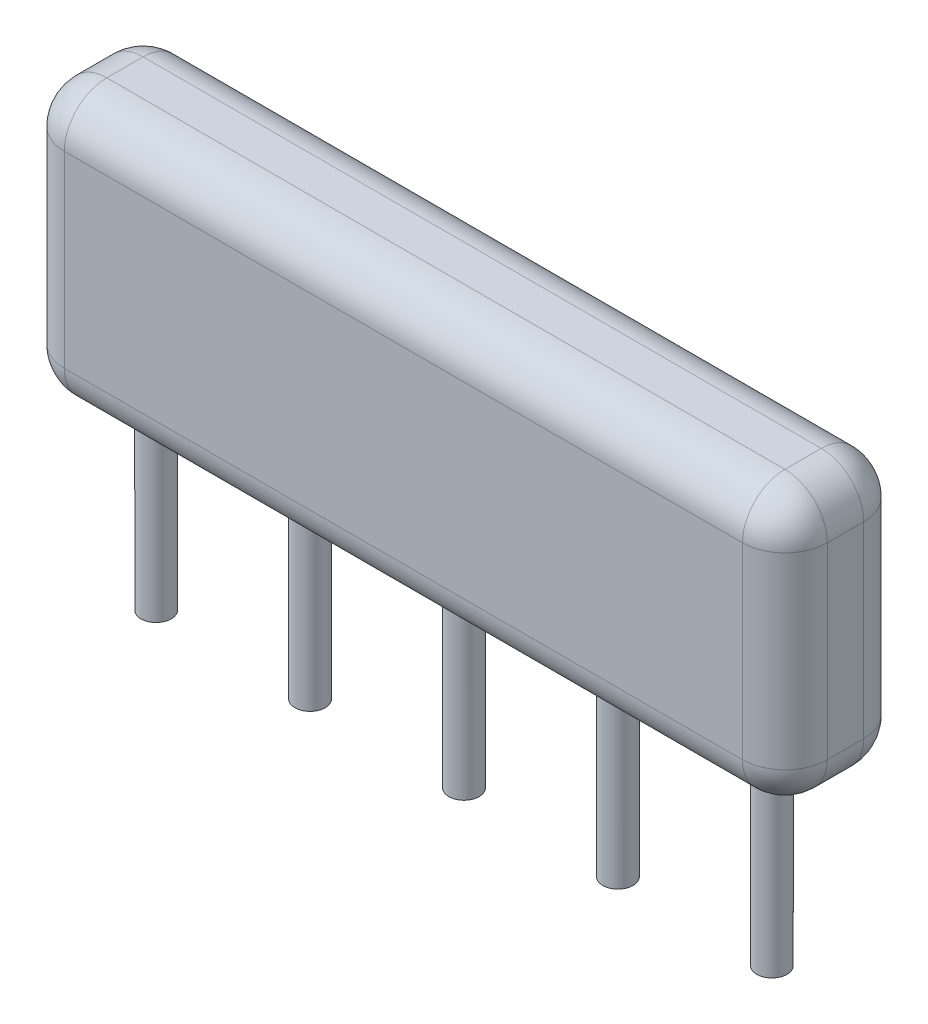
ISO-10303-21;
HEADER;
FILE_DESCRIPTION(('STEP AP214'),'2;1');
FILE_NAME('part.step','',(''),(''),'','','');
FILE_SCHEMA(('AUTOMOTIVE_DESIGN { 1 0 10303 214 1 1 1 1 }'));
ENDSEC;
DATA;
#1=APPLICATION_CONTEXT('core data for automotive mechanical design processes');
#2=APPLICATION_PROTOCOL_DEFINITION('international standard','automotive_design',2000,#1);
#3=PRODUCT_CONTEXT('',#1,'mechanical');
#4=PRODUCT('Part','Part','',(#3));
#5=PRODUCT_RELATED_PRODUCT_CATEGORY('part','',(#4));
#6=PRODUCT_DEFINITION_FORMATION('','',#4);
#7=PRODUCT_DEFINITION_CONTEXT('part definition',#1,'design');
#8=PRODUCT_DEFINITION('design','',#6,#7);
#9=PRODUCT_DEFINITION_SHAPE('','',#8);
#10=(LENGTH_UNIT() NAMED_UNIT(*) SI_UNIT(.MILLI.,.METRE.));
#11=(NAMED_UNIT(*) PLANE_ANGLE_UNIT() SI_UNIT($,.RADIAN.));
#12=(NAMED_UNIT(*) SI_UNIT($,.STERADIAN.) SOLID_ANGLE_UNIT());
#13=UNCERTAINTY_MEASURE_WITH_UNIT(LENGTH_MEASURE(1.E-05),#10,'distance_accuracy_value','');
#14=(GEOMETRIC_REPRESENTATION_CONTEXT(3) GLOBAL_UNCERTAINTY_ASSIGNED_CONTEXT((#13)) GLOBAL_UNIT_ASSIGNED_CONTEXT((#10,
#11,#12)) REPRESENTATION_CONTEXT('',''));
#15=CARTESIAN_POINT('',(0.,0.,0.));
#16=DIRECTION('',(0.,0.,1.));
#17=DIRECTION('',(1.,0.,0.));
#18=AXIS2_PLACEMENT_3D('',#15,#16,#17);
#19=CARTESIAN_POINT('',(0.,0.,2.));
#20=DIRECTION('',(0.,1.,0.));
#21=DIRECTION('',(0.,0.,1.));
#22=AXIS2_PLACEMENT_3D('',#19,#20,#21);
#23=PLANE('',#22);
#24=DIRECTION('',(0.,0.,-1.));
#25=VECTOR('',#24,1.);
#26=CARTESIAN_POINT('',(0.7,0.,2.));
#27=LINE('',#26,#25);
#28=CARTESIAN_POINT('',(0.7,0.,1.3));
#29=VERTEX_POINT('',#28);
#30=CARTESIAN_POINT('',(0.7,0.,0.7));
#31=VERTEX_POINT('',#30);
#32=EDGE_CURVE('E162',#29,#31,#27,.T.);
#33=ORIENTED_EDGE('',*,*,#32,.T.);
#34=DIRECTION('',(1.,0.,0.));
#35=VECTOR('',#34,1.);
#36=CARTESIAN_POINT('',(0.,0.,0.7));
#37=LINE('',#36,#35);
#38=CARTESIAN_POINT('',(11.89,0.,0.7));
#39=VERTEX_POINT('',#38);
#40=EDGE_CURVE('E251',#31,#39,#37,.T.);
#41=ORIENTED_EDGE('',*,*,#40,.T.);
#42=DIRECTION('',(0.,0.,-1.));
#43=VECTOR('',#42,1.);
#44=CARTESIAN_POINT('',(11.89,0.,2.));
#45=LINE('',#44,#43);
#46=CARTESIAN_POINT('',(11.89,0.,1.3));
#47=VERTEX_POINT('',#46);
#48=EDGE_CURVE('E248',#39,#47,#45,.F.);
#49=ORIENTED_EDGE('',*,*,#48,.T.);
#50=DIRECTION('',(1.,0.,0.));
#51=VECTOR('',#50,1.);
#52=CARTESIAN_POINT('',(0.,0.,1.3));
#53=LINE('',#52,#51);
#54=EDGE_CURVE('E246',#47,#29,#53,.F.);
#55=ORIENTED_EDGE('',*,*,#54,.T.);
#56=EDGE_LOOP('',(#33,#41,#49,#55));
#57=FACE_BOUND('',#56,.T.);
#58=CARTESIAN_POINT('',(8.835,0.,1.));
#59=DIRECTION('',(0.,1.,0.));
#60=DIRECTION('',(0.,0.,1.));
#61=AXIS2_PLACEMENT_3D('',#58,#59,#60);
#62=CIRCLE('',#61,0.25);
#63=CARTESIAN_POINT('',(8.835,0.,1.25));
#64=VERTEX_POINT('',#63);
#65=EDGE_CURVE('E230',#64,#64,#62,.F.);
#66=ORIENTED_EDGE('',*,*,#65,.F.);
#67=EDGE_LOOP('',(#66));
#68=FACE_BOUND('',#67,.T.);
#69=CARTESIAN_POINT('',(3.755,0.,1.));
#70=DIRECTION('',(0.,1.,0.));
#71=DIRECTION('',(0.,0.,1.));
#72=AXIS2_PLACEMENT_3D('',#69,#70,#71);
#73=CIRCLE('',#72,0.25);
#74=CARTESIAN_POINT('',(3.755,0.,1.25));
#75=VERTEX_POINT('',#74);
#76=EDGE_CURVE('E224',#75,#75,#73,.F.);
#77=ORIENTED_EDGE('',*,*,#76,.F.);
#78=EDGE_LOOP('',(#77));
#79=FACE_BOUND('',#78,.T.);
#80=CARTESIAN_POINT('',(1.215,0.,1.));
#81=DIRECTION('',(0.,1.,0.));
#82=DIRECTION('',(0.,0.,1.));
#83=AXIS2_PLACEMENT_3D('',#80,#81,#82);
#84=CIRCLE('',#83,0.25);
#85=CARTESIAN_POINT('',(1.215,0.,1.25));
#86=VERTEX_POINT('',#85);
#87=EDGE_CURVE('E221',#86,#86,#84,.F.);
#88=ORIENTED_EDGE('',*,*,#87,.F.);
#89=EDGE_LOOP('',(#88));
#90=FACE_BOUND('',#89,.T.);
#91=CARTESIAN_POINT('',(6.295,0.,1.));
#92=DIRECTION('',(0.,1.,0.));
#93=DIRECTION('',(0.,0.,1.));
#94=AXIS2_PLACEMENT_3D('',#91,#92,#93);
#95=CIRCLE('',#94,0.25);
#96=CARTESIAN_POINT('',(6.295,0.,1.25));
#97=VERTEX_POINT('',#96);
#98=EDGE_CURVE('E227',#97,#97,#95,.F.);
#99=ORIENTED_EDGE('',*,*,#98,.F.);
#100=EDGE_LOOP('',(#99));
#101=FACE_BOUND('',#100,.T.);
#102=CARTESIAN_POINT('',(11.375,0.,1.));
#103=DIRECTION('',(0.,1.,0.));
#104=DIRECTION('',(0.,0.,1.));
#105=AXIS2_PLACEMENT_3D('',#102,#103,#104);
#106=CIRCLE('',#105,0.25);
#107=CARTESIAN_POINT('',(11.375,0.,1.25));
#108=VERTEX_POINT('',#107);
#109=EDGE_CURVE('E150',#108,#108,#106,.F.);
#110=ORIENTED_EDGE('',*,*,#109,.F.);
#111=EDGE_LOOP('',(#110));
#112=FACE_BOUND('',#111,.T.);
#113=ADVANCED_FACE('F39',(#57,#68,#79,#90,#101,#112),#23,.F.);
#114=CARTESIAN_POINT('',(0.,4.5,2.));
#115=DIRECTION('',(1.,0.,0.));
#116=DIRECTION('',(0.,0.,-1.));
#117=AXIS2_PLACEMENT_3D('',#114,#115,#116);
#118=PLANE('',#117);
#119=DIRECTION('',(0.,0.,-1.));
#120=VECTOR('',#119,1.);
#121=CARTESIAN_POINT('',(0.,3.8,2.));
#122=LINE('',#121,#120);
#123=CARTESIAN_POINT('',(0.,3.8,1.3));
#124=VERTEX_POINT('',#123);
#125=CARTESIAN_POINT('',(0.,3.8,0.7));
#126=VERTEX_POINT('',#125);
#127=EDGE_CURVE('E138',#124,#126,#122,.T.);
#128=ORIENTED_EDGE('',*,*,#127,.T.);
#129=DIRECTION('',(0.,-1.,0.));
#130=VECTOR('',#129,1.);
#131=CARTESIAN_POINT('',(0.,4.5,0.7));
#132=LINE('',#131,#130);
#133=CARTESIAN_POINT('',(0.,0.7,0.7));
#134=VERTEX_POINT('',#133);
#135=EDGE_CURVE('E134',#126,#134,#132,.T.);
#136=ORIENTED_EDGE('',*,*,#135,.T.);
#137=DIRECTION('',(0.,0.,-1.));
#138=VECTOR('',#137,1.);
#139=CARTESIAN_POINT('',(0.,0.7,2.));
#140=LINE('',#139,#138);
#141=CARTESIAN_POINT('',(0.,0.7,1.3));
#142=VERTEX_POINT('',#141);
#143=EDGE_CURVE('E129',#134,#142,#140,.F.);
#144=ORIENTED_EDGE('',*,*,#143,.T.);
#145=DIRECTION('',(0.,-1.,0.));
#146=VECTOR('',#145,1.);
#147=CARTESIAN_POINT('',(0.,4.5,1.3));
#148=LINE('',#147,#146);
#149=EDGE_CURVE('E131',#142,#124,#148,.F.);
#150=ORIENTED_EDGE('',*,*,#149,.T.);
#151=EDGE_LOOP('',(#128,#136,#144,#150));
#152=FACE_BOUND('',#151,.T.);
#153=ADVANCED_FACE('F41',(#152),#118,.F.);
#154=CARTESIAN_POINT('',(12.59,4.5,2.));
#155=DIRECTION('',(-1.,0.,0.));
#156=DIRECTION('',(0.,0.,1.));
#157=AXIS2_PLACEMENT_3D('',#154,#155,#156);
#158=PLANE('',#157);
#159=DIRECTION('',(0.,0.,-1.));
#160=VECTOR('',#159,1.);
#161=CARTESIAN_POINT('',(12.59,0.7,2.));
#162=LINE('',#161,#160);
#163=CARTESIAN_POINT('',(12.59,0.7,1.3));
#164=VERTEX_POINT('',#163);
#165=CARTESIAN_POINT('',(12.59,0.7,0.7));
#166=VERTEX_POINT('',#165);
#167=EDGE_CURVE('E257',#164,#166,#162,.T.);
#168=ORIENTED_EDGE('',*,*,#167,.T.);
#169=DIRECTION('',(0.,1.,0.));
#170=VECTOR('',#169,1.);
#171=CARTESIAN_POINT('',(12.59,4.5,0.7));
#172=LINE('',#171,#170);
#173=CARTESIAN_POINT('',(12.59,3.8,0.7));
#174=VERTEX_POINT('',#173);
#175=EDGE_CURVE('E260',#166,#174,#172,.T.);
#176=ORIENTED_EDGE('',*,*,#175,.T.);
#177=DIRECTION('',(0.,0.,-1.));
#178=VECTOR('',#177,1.);
#179=CARTESIAN_POINT('',(12.59,3.8,2.));
#180=LINE('',#179,#178);
#181=CARTESIAN_POINT('',(12.59,3.8,1.3));
#182=VERTEX_POINT('',#181);
#183=EDGE_CURVE('E255',#174,#182,#180,.F.);
#184=ORIENTED_EDGE('',*,*,#183,.T.);
#185=DIRECTION('',(0.,1.,0.));
#186=VECTOR('',#185,1.);
#187=CARTESIAN_POINT('',(12.59,0.,1.3));
#188=LINE('',#187,#186);
#189=EDGE_CURVE('E253',#182,#164,#188,.F.);
#190=ORIENTED_EDGE('',*,*,#189,.T.);
#191=EDGE_LOOP('',(#168,#176,#184,#190));
#192=FACE_BOUND('',#191,.T.);
#193=ADVANCED_FACE('F347',(#192),#158,.F.);
#194=CARTESIAN_POINT('',(0.,4.5,2.));
#195=DIRECTION('',(0.,-1.,0.));
#196=DIRECTION('',(0.,0.,-1.));
#197=AXIS2_PLACEMENT_3D('',#194,#195,#196);
#198=PLANE('',#197);
#199=DIRECTION('',(0.,0.,-1.));
#200=VECTOR('',#199,1.);
#201=CARTESIAN_POINT('',(11.89,4.5,2.));
#202=LINE('',#201,#200);
#203=CARTESIAN_POINT('',(11.89,4.5,1.3));
#204=VERTEX_POINT('',#203);
#205=CARTESIAN_POINT('',(11.89,4.5,0.7));
#206=VERTEX_POINT('',#205);
#207=EDGE_CURVE('E264',#204,#206,#202,.T.);
#208=ORIENTED_EDGE('',*,*,#207,.T.);
#209=DIRECTION('',(-1.,0.,0.));
#210=VECTOR('',#209,1.);
#211=CARTESIAN_POINT('',(0.,4.5,0.7));
#212=LINE('',#211,#210);
#213=CARTESIAN_POINT('',(0.7,4.5,0.7));
#214=VERTEX_POINT('',#213);
#215=EDGE_CURVE('E269',#206,#214,#212,.T.);
#216=ORIENTED_EDGE('',*,*,#215,.T.);
#217=DIRECTION('',(0.,0.,-1.));
#218=VECTOR('',#217,1.);
#219=CARTESIAN_POINT('',(0.7,4.5,2.));
#220=LINE('',#219,#218);
#221=CARTESIAN_POINT('',(0.7,4.5,1.3));
#222=VERTEX_POINT('',#221);
#223=EDGE_CURVE('E266',#214,#222,#220,.F.);
#224=ORIENTED_EDGE('',*,*,#223,.T.);
#225=DIRECTION('',(-1.,0.,0.));
#226=VECTOR('',#225,1.);
#227=CARTESIAN_POINT('',(12.59,4.5,1.3));
#228=LINE('',#227,#226);
#229=EDGE_CURVE('E262',#222,#204,#228,.F.);
#230=ORIENTED_EDGE('',*,*,#229,.T.);
#231=EDGE_LOOP('',(#208,#216,#224,#230));
#232=FACE_BOUND('',#231,.T.);
#233=ADVANCED_FACE('F353',(#232),#198,.F.);
#234=CARTESIAN_POINT('',(0.,0.,2.));
#235=DIRECTION('',(0.,0.,1.));
#236=DIRECTION('',(1.,0.,0.));
#237=AXIS2_PLACEMENT_3D('',#234,#235,#236);
#238=PLANE('',#237);
#239=DIRECTION('',(1.,0.,0.));
#240=VECTOR('',#239,1.);
#241=CARTESIAN_POINT('',(12.59,0.7,2.));
#242=LINE('',#241,#240);
#243=CARTESIAN_POINT('',(0.7,0.7,2.));
#244=VERTEX_POINT('',#243);
#245=CARTESIAN_POINT('',(11.89,0.7,2.));
#246=VERTEX_POINT('',#245);
#247=EDGE_CURVE('E47',#244,#246,#242,.T.);
#248=ORIENTED_EDGE('',*,*,#247,.T.);
#249=DIRECTION('',(0.,1.,0.));
#250=VECTOR('',#249,1.);
#251=CARTESIAN_POINT('',(11.89,4.5,2.));
#252=LINE('',#251,#250);
#253=CARTESIAN_POINT('',(11.89,3.8,2.));
#254=VERTEX_POINT('',#253);
#255=EDGE_CURVE('E11',#246,#254,#252,.T.);
#256=ORIENTED_EDGE('',*,*,#255,.T.);
#257=DIRECTION('',(-1.,0.,0.));
#258=VECTOR('',#257,1.);
#259=CARTESIAN_POINT('',(0.,3.8,2.));
#260=LINE('',#259,#258);
#261=CARTESIAN_POINT('',(0.7,3.8,2.));
#262=VERTEX_POINT('',#261);
#263=EDGE_CURVE('E273',#254,#262,#260,.T.);
#264=ORIENTED_EDGE('',*,*,#263,.T.);
#265=DIRECTION('',(0.,-1.,0.));
#266=VECTOR('',#265,1.);
#267=CARTESIAN_POINT('',(0.7,0.,2.));
#268=LINE('',#267,#266);
#269=EDGE_CURVE('E271',#262,#244,#268,.T.);
#270=ORIENTED_EDGE('',*,*,#269,.T.);
#271=EDGE_LOOP('',(#248,#256,#264,#270));
#272=FACE_BOUND('',#271,.T.);
#273=ADVANCED_FACE('F274',(#272),#238,.T.);
#274=CARTESIAN_POINT('',(0.,0.,0.));
#275=DIRECTION('',(0.,0.,1.));
#276=DIRECTION('',(1.,0.,0.));
#277=AXIS2_PLACEMENT_3D('',#274,#275,#276);
#278=PLANE('',#277);
#279=DIRECTION('',(1.,0.,0.));
#280=VECTOR('',#279,1.);
#281=CARTESIAN_POINT('',(0.,0.7,0.));
#282=LINE('',#281,#280);
#283=CARTESIAN_POINT('',(11.89,0.7,0.));
#284=VERTEX_POINT('',#283);
#285=CARTESIAN_POINT('',(0.7,0.7,0.));
#286=VERTEX_POINT('',#285);
#287=EDGE_CURVE('E241',#284,#286,#282,.F.);
#288=ORIENTED_EDGE('',*,*,#287,.T.);
#289=DIRECTION('',(0.,-1.,0.));
#290=VECTOR('',#289,1.);
#291=CARTESIAN_POINT('',(0.7,0.,0.));
#292=LINE('',#291,#290);
#293=CARTESIAN_POINT('',(0.7,3.8,0.));
#294=VERTEX_POINT('',#293);
#295=EDGE_CURVE('E243',#286,#294,#292,.F.);
#296=ORIENTED_EDGE('',*,*,#295,.T.);
#297=DIRECTION('',(-1.,0.,0.));
#298=VECTOR('',#297,1.);
#299=CARTESIAN_POINT('',(0.,3.8,0.));
#300=LINE('',#299,#298);
#301=CARTESIAN_POINT('',(11.89,3.8,0.));
#302=VERTEX_POINT('',#301);
#303=EDGE_CURVE('E239',#294,#302,#300,.F.);
#304=ORIENTED_EDGE('',*,*,#303,.T.);
#305=DIRECTION('',(0.,1.,0.));
#306=VECTOR('',#305,1.);
#307=CARTESIAN_POINT('',(11.89,0.,0.));
#308=LINE('',#307,#306);
#309=EDGE_CURVE('E237',#302,#284,#308,.F.);
#310=ORIENTED_EDGE('',*,*,#309,.T.);
#311=EDGE_LOOP('',(#288,#296,#304,#310));
#312=FACE_BOUND('',#311,.T.);
#313=ADVANCED_FACE('F358',(#312),#278,.F.);
#314=CARTESIAN_POINT('',(1.215,-3.,1.));
#315=DIRECTION('',(0.,1.,0.));
#316=DIRECTION('',(0.,0.,1.));
#317=AXIS2_PLACEMENT_3D('',#314,#315,#316);
#318=CYLINDRICAL_SURFACE('',#317,0.25);
#319=CARTESIAN_POINT('',(1.215,-3.,1.));
#320=DIRECTION('',(0.,-1.,0.));
#321=DIRECTION('',(0.,0.,-1.));
#322=AXIS2_PLACEMENT_3D('',#319,#320,#321);
#323=CIRCLE('',#322,0.25);
#324=CARTESIAN_POINT('',(1.215,-3.,0.75));
#325=VERTEX_POINT('',#324);
#326=EDGE_CURVE('E218',#325,#325,#323,.T.);
#327=ORIENTED_EDGE('',*,*,#326,.F.);
#328=EDGE_LOOP('',(#327));
#329=FACE_BOUND('',#328,.T.);
#330=ORIENTED_EDGE('',*,*,#87,.T.);
#331=EDGE_LOOP('',(#330));
#332=FACE_BOUND('',#331,.T.);
#333=ADVANCED_FACE('F382',(#329,#332),#318,.T.);
#334=CARTESIAN_POINT('',(1.215,-3.,1.));
#335=DIRECTION('',(0.,-1.,0.));
#336=DIRECTION('',(0.,0.,-1.));
#337=AXIS2_PLACEMENT_3D('',#334,#335,#336);
#338=PLANE('',#337);
#339=ORIENTED_EDGE('',*,*,#326,.T.);
#340=EDGE_LOOP('',(#339));
#341=FACE_BOUND('',#340,.T.);
#342=ADVANCED_FACE('F385',(#341),#338,.T.);
#343=CARTESIAN_POINT('',(3.755,-3.,1.));
#344=DIRECTION('',(0.,1.,0.));
#345=DIRECTION('',(0.,0.,1.));
#346=AXIS2_PLACEMENT_3D('',#343,#344,#345);
#347=CYLINDRICAL_SURFACE('',#346,0.25);
#348=CARTESIAN_POINT('',(3.755,-3.,1.));
#349=DIRECTION('',(0.,-1.,0.));
#350=DIRECTION('',(0.,0.,-1.));
#351=AXIS2_PLACEMENT_3D('',#348,#349,#350);
#352=CIRCLE('',#351,0.25);
#353=CARTESIAN_POINT('',(3.755,-3.,0.75));
#354=VERTEX_POINT('',#353);
#355=EDGE_CURVE('E215',#354,#354,#352,.T.);
#356=ORIENTED_EDGE('',*,*,#355,.F.);
#357=EDGE_LOOP('',(#356));
#358=FACE_BOUND('',#357,.T.);
#359=ORIENTED_EDGE('',*,*,#76,.T.);
#360=EDGE_LOOP('',(#359));
#361=FACE_BOUND('',#360,.T.);
#362=ADVANCED_FACE('F389',(#358,#361),#347,.T.);
#363=CARTESIAN_POINT('',(3.755,-3.,1.));
#364=DIRECTION('',(0.,-1.,0.));
#365=DIRECTION('',(0.,0.,-1.));
#366=AXIS2_PLACEMENT_3D('',#363,#364,#365);
#367=PLANE('',#366);
#368=ORIENTED_EDGE('',*,*,#355,.T.);
#369=EDGE_LOOP('',(#368));
#370=FACE_BOUND('',#369,.T.);
#371=ADVANCED_FACE('F393',(#370),#367,.T.);
#372=CARTESIAN_POINT('',(6.295,-3.,1.));
#373=DIRECTION('',(0.,1.,0.));
#374=DIRECTION('',(0.,0.,1.));
#375=AXIS2_PLACEMENT_3D('',#372,#373,#374);
#376=CYLINDRICAL_SURFACE('',#375,0.25);
#377=CARTESIAN_POINT('',(6.295,-3.,1.));
#378=DIRECTION('',(0.,-1.,0.));
#379=DIRECTION('',(0.,0.,-1.));
#380=AXIS2_PLACEMENT_3D('',#377,#378,#379);
#381=CIRCLE('',#380,0.25);
#382=CARTESIAN_POINT('',(6.295,-3.,0.75));
#383=VERTEX_POINT('',#382);
#384=EDGE_CURVE('E212',#383,#383,#381,.T.);
#385=ORIENTED_EDGE('',*,*,#384,.F.);
#386=EDGE_LOOP('',(#385));
#387=FACE_BOUND('',#386,.T.);
#388=ORIENTED_EDGE('',*,*,#98,.T.);
#389=EDGE_LOOP('',(#388));
#390=FACE_BOUND('',#389,.T.);
#391=ADVANCED_FACE('F397',(#387,#390),#376,.T.);
#392=CARTESIAN_POINT('',(6.295,-3.,1.));
#393=DIRECTION('',(0.,-1.,0.));
#394=DIRECTION('',(0.,0.,-1.));
#395=AXIS2_PLACEMENT_3D('',#392,#393,#394);
#396=PLANE('',#395);
#397=ORIENTED_EDGE('',*,*,#384,.T.);
#398=EDGE_LOOP('',(#397));
#399=FACE_BOUND('',#398,.T.);
#400=ADVANCED_FACE('F401',(#399),#396,.T.);
#401=CARTESIAN_POINT('',(8.835,-3.,1.));
#402=DIRECTION('',(0.,1.,0.));
#403=DIRECTION('',(0.,0.,1.));
#404=AXIS2_PLACEMENT_3D('',#401,#402,#403);
#405=CYLINDRICAL_SURFACE('',#404,0.25);
#406=CARTESIAN_POINT('',(8.835,-3.,1.));
#407=DIRECTION('',(0.,-1.,0.));
#408=DIRECTION('',(0.,0.,-1.));
#409=AXIS2_PLACEMENT_3D('',#406,#407,#408);
#410=CIRCLE('',#409,0.25);
#411=CARTESIAN_POINT('',(8.835,-3.,0.75));
#412=VERTEX_POINT('',#411);
#413=EDGE_CURVE('E209',#412,#412,#410,.T.);
#414=ORIENTED_EDGE('',*,*,#413,.F.);
#415=EDGE_LOOP('',(#414));
#416=FACE_BOUND('',#415,.T.);
#417=ORIENTED_EDGE('',*,*,#65,.T.);
#418=EDGE_LOOP('',(#417));
#419=FACE_BOUND('',#418,.T.);
#420=ADVANCED_FACE('F405',(#416,#419),#405,.T.);
#421=CARTESIAN_POINT('',(8.835,-3.,1.));
#422=DIRECTION('',(0.,-1.,0.));
#423=DIRECTION('',(0.,0.,-1.));
#424=AXIS2_PLACEMENT_3D('',#421,#422,#423);
#425=PLANE('',#424);
#426=ORIENTED_EDGE('',*,*,#413,.T.);
#427=EDGE_LOOP('',(#426));
#428=FACE_BOUND('',#427,.T.);
#429=ADVANCED_FACE('F409',(#428),#425,.T.);
#430=CARTESIAN_POINT('',(11.375,-3.,1.));
#431=DIRECTION('',(0.,1.,0.));
#432=DIRECTION('',(0.,0.,1.));
#433=AXIS2_PLACEMENT_3D('',#430,#431,#432);
#434=CYLINDRICAL_SURFACE('',#433,0.25);
#435=CARTESIAN_POINT('',(11.375,-3.,1.));
#436=DIRECTION('',(0.,-1.,0.));
#437=DIRECTION('',(0.,0.,-1.));
#438=AXIS2_PLACEMENT_3D('',#435,#436,#437);
#439=CIRCLE('',#438,0.25);
#440=CARTESIAN_POINT('',(11.375,-3.,0.75));
#441=VERTEX_POINT('',#440);
#442=EDGE_CURVE('E206',#441,#441,#439,.T.);
#443=ORIENTED_EDGE('',*,*,#442,.F.);
#444=EDGE_LOOP('',(#443));
#445=FACE_BOUND('',#444,.T.);
#446=ORIENTED_EDGE('',*,*,#109,.T.);
#447=EDGE_LOOP('',(#446));
#448=FACE_BOUND('',#447,.T.);
#449=ADVANCED_FACE('F413',(#445,#448),#434,.T.);
#450=CARTESIAN_POINT('',(11.375,-3.,1.));
#451=DIRECTION('',(0.,-1.,0.));
#452=DIRECTION('',(0.,0.,-1.));
#453=AXIS2_PLACEMENT_3D('',#450,#451,#452);
#454=PLANE('',#453);
#455=ORIENTED_EDGE('',*,*,#442,.T.);
#456=EDGE_LOOP('',(#455));
#457=FACE_BOUND('',#456,.T.);
#458=ADVANCED_FACE('F417',(#457),#454,.T.);
#459=CARTESIAN_POINT('',(11.89,0.,1.3));
#460=DIRECTION('',(0.,-1.,0.));
#461=DIRECTION('',(0.,0.,-1.));
#462=AXIS2_PLACEMENT_3D('',#459,#460,#461);
#463=CYLINDRICAL_SURFACE('',#462,0.7);
#464=CARTESIAN_POINT('',(11.89,3.8,1.3));
#465=DIRECTION('',(0.,1.,0.));
#466=DIRECTION('',(0.,0.,1.));
#467=AXIS2_PLACEMENT_3D('',#464,#465,#466);
#468=CIRCLE('',#467,0.7);
#469=EDGE_CURVE('E203',#254,#182,#468,.T.);
#470=ORIENTED_EDGE('',*,*,#469,.F.);
#471=ORIENTED_EDGE('',*,*,#255,.F.);
#472=CARTESIAN_POINT('',(11.89,0.7,1.3));
#473=DIRECTION('',(0.,-1.,0.));
#474=DIRECTION('',(0.,0.,-1.));
#475=AXIS2_PLACEMENT_3D('',#472,#473,#474);
#476=CIRCLE('',#475,0.7);
#477=EDGE_CURVE('E201',#164,#246,#476,.T.);
#478=ORIENTED_EDGE('',*,*,#477,.F.);
#479=ORIENTED_EDGE('',*,*,#189,.F.);
#480=EDGE_LOOP('',(#470,#471,#478,#479));
#481=FACE_BOUND('',#480,.T.);
#482=ADVANCED_FACE('F290',(#481),#463,.T.);
#483=CARTESIAN_POINT('',(11.89,3.8,1.3));
#484=DIRECTION('',(0.,0.,1.));
#485=DIRECTION('',(1.,0.,0.));
#486=AXIS2_PLACEMENT_3D('',#483,#484,#485);
#487=SPHERICAL_SURFACE('',#486,0.7);
#488=CARTESIAN_POINT('',(11.89,3.8,1.3));
#489=DIRECTION('',(1.,0.,0.));
#490=DIRECTION('',(0.,0.,-1.));
#491=AXIS2_PLACEMENT_3D('',#488,#489,#490);
#492=CIRCLE('',#491,0.7);
#493=EDGE_CURVE('E195',#254,#204,#492,.F.);
#494=ORIENTED_EDGE('',*,*,#493,.F.);
#495=ORIENTED_EDGE('',*,*,#469,.T.);
#496=CARTESIAN_POINT('',(11.89,3.8,1.3));
#497=DIRECTION('',(0.,0.,1.));
#498=DIRECTION('',(1.,0.,0.));
#499=AXIS2_PLACEMENT_3D('',#496,#497,#498);
#500=CIRCLE('',#499,0.7);
#501=EDGE_CURVE('E198',#204,#182,#500,.F.);
#502=ORIENTED_EDGE('',*,*,#501,.F.);
#503=EDGE_LOOP('',(#494,#495,#502));
#504=FACE_BOUND('',#503,.T.);
#505=ADVANCED_FACE('F295',(#504),#487,.T.);
#506=CARTESIAN_POINT('',(11.89,0.7,1.3));
#507=DIRECTION('',(0.,0.,1.));
#508=DIRECTION('',(1.,0.,0.));
#509=AXIS2_PLACEMENT_3D('',#506,#507,#508);
#510=SPHERICAL_SURFACE('',#509,0.7);
#511=CARTESIAN_POINT('',(11.89,0.7,1.3));
#512=DIRECTION('',(0.,0.,1.));
#513=DIRECTION('',(1.,0.,0.));
#514=AXIS2_PLACEMENT_3D('',#511,#512,#513);
#515=CIRCLE('',#514,0.7);
#516=EDGE_CURVE('E191',#164,#47,#515,.F.);
#517=ORIENTED_EDGE('',*,*,#516,.F.);
#518=ORIENTED_EDGE('',*,*,#477,.T.);
#519=CARTESIAN_POINT('',(11.89,0.7,1.3));
#520=DIRECTION('',(1.,0.,0.));
#521=DIRECTION('',(0.,0.,-1.));
#522=AXIS2_PLACEMENT_3D('',#519,#520,#521);
#523=CIRCLE('',#522,0.7);
#524=EDGE_CURVE('E54',#47,#246,#523,.F.);
#525=ORIENTED_EDGE('',*,*,#524,.F.);
#526=EDGE_LOOP('',(#517,#518,#525));
#527=FACE_BOUND('',#526,.T.);
#528=ADVANCED_FACE('F286',(#527),#510,.T.);
#529=CARTESIAN_POINT('',(11.89,3.8,2.));
#530=DIRECTION('',(0.,0.,-1.));
#531=DIRECTION('',(-1.,0.,0.));
#532=AXIS2_PLACEMENT_3D('',#529,#530,#531);
#533=CYLINDRICAL_SURFACE('',#532,0.7);
#534=ORIENTED_EDGE('',*,*,#501,.T.);
#535=ORIENTED_EDGE('',*,*,#183,.F.);
#536=CARTESIAN_POINT('',(11.89,3.8,0.7));
#537=DIRECTION('',(0.,0.,-1.));
#538=DIRECTION('',(-1.,0.,0.));
#539=AXIS2_PLACEMENT_3D('',#536,#537,#538);
#540=CIRCLE('',#539,0.7);
#541=EDGE_CURVE('E185',#206,#174,#540,.T.);
#542=ORIENTED_EDGE('',*,*,#541,.F.);
#543=ORIENTED_EDGE('',*,*,#207,.F.);
#544=EDGE_LOOP('',(#534,#535,#542,#543));
#545=FACE_BOUND('',#544,.T.);
#546=ADVANCED_FACE('F350',(#545),#533,.T.);
#547=CARTESIAN_POINT('',(0.,3.8,1.3));
#548=DIRECTION('',(1.,0.,0.));
#549=DIRECTION('',(0.,0.,-1.));
#550=AXIS2_PLACEMENT_3D('',#547,#548,#549);
#551=CYLINDRICAL_SURFACE('',#550,0.7);
#552=ORIENTED_EDGE('',*,*,#493,.T.);
#553=ORIENTED_EDGE('',*,*,#229,.F.);
#554=CARTESIAN_POINT('',(0.7,3.8,1.3));
#555=DIRECTION('',(-1.,0.,0.));
#556=DIRECTION('',(0.,0.,1.));
#557=AXIS2_PLACEMENT_3D('',#554,#555,#556);
#558=CIRCLE('',#557,0.7);
#559=EDGE_CURVE('E182',#262,#222,#558,.T.);
#560=ORIENTED_EDGE('',*,*,#559,.F.);
#561=ORIENTED_EDGE('',*,*,#263,.F.);
#562=EDGE_LOOP('',(#552,#553,#560,#561));
#563=FACE_BOUND('',#562,.T.);
#564=ADVANCED_FACE('F300',(#563),#551,.T.);
#565=CARTESIAN_POINT('',(0.7,0.,1.3));
#566=DIRECTION('',(0.,1.,0.));
#567=DIRECTION('',(0.,0.,1.));
#568=AXIS2_PLACEMENT_3D('',#565,#566,#567);
#569=CYLINDRICAL_SURFACE('',#568,0.7);
#570=CARTESIAN_POINT('',(0.7,0.7,1.3));
#571=DIRECTION('',(0.,-1.,0.));
#572=DIRECTION('',(0.,0.,-1.));
#573=AXIS2_PLACEMENT_3D('',#570,#571,#572);
#574=CIRCLE('',#573,0.7);
#575=EDGE_CURVE('E145',#244,#142,#574,.T.);
#576=ORIENTED_EDGE('',*,*,#575,.F.);
#577=ORIENTED_EDGE('',*,*,#269,.F.);
#578=CARTESIAN_POINT('',(0.7,3.8,1.3));
#579=DIRECTION('',(0.,1.,0.));
#580=DIRECTION('',(0.,0.,1.));
#581=AXIS2_PLACEMENT_3D('',#578,#579,#580);
#582=CIRCLE('',#581,0.7);
#583=EDGE_CURVE('E148',#124,#262,#582,.T.);
#584=ORIENTED_EDGE('',*,*,#583,.F.);
#585=ORIENTED_EDGE('',*,*,#149,.F.);
#586=EDGE_LOOP('',(#576,#577,#584,#585));
#587=FACE_BOUND('',#586,.T.);
#588=ADVANCED_FACE('F143',(#587),#569,.T.);
#589=CARTESIAN_POINT('',(0.,0.7,1.3));
#590=DIRECTION('',(-1.,0.,0.));
#591=DIRECTION('',(0.,0.,1.));
#592=AXIS2_PLACEMENT_3D('',#589,#590,#591);
#593=CYLINDRICAL_SURFACE('',#592,0.7);
#594=ORIENTED_EDGE('',*,*,#524,.T.);
#595=ORIENTED_EDGE('',*,*,#247,.F.);
#596=CARTESIAN_POINT('',(0.7,0.7,1.3));
#597=DIRECTION('',(-1.,0.,0.));
#598=DIRECTION('',(0.,0.,1.));
#599=AXIS2_PLACEMENT_3D('',#596,#597,#598);
#600=CIRCLE('',#599,0.7);
#601=EDGE_CURVE('E158',#29,#244,#600,.T.);
#602=ORIENTED_EDGE('',*,*,#601,.F.);
#603=ORIENTED_EDGE('',*,*,#54,.F.);
#604=EDGE_LOOP('',(#594,#595,#602,#603));
#605=FACE_BOUND('',#604,.T.);
#606=ADVANCED_FACE('F275',(#605),#593,.T.);
#607=CARTESIAN_POINT('',(11.89,0.7,2.));
#608=DIRECTION('',(0.,0.,-1.));
#609=DIRECTION('',(-1.,0.,0.));
#610=AXIS2_PLACEMENT_3D('',#607,#608,#609);
#611=CYLINDRICAL_SURFACE('',#610,0.7);
#612=ORIENTED_EDGE('',*,*,#516,.T.);
#613=ORIENTED_EDGE('',*,*,#48,.F.);
#614=CARTESIAN_POINT('',(11.89,0.7,0.7));
#615=DIRECTION('',(0.,0.,-1.));
#616=DIRECTION('',(-1.,0.,0.));
#617=AXIS2_PLACEMENT_3D('',#614,#615,#616);
#618=CIRCLE('',#617,0.7);
#619=EDGE_CURVE('E177',#166,#39,#618,.T.);
#620=ORIENTED_EDGE('',*,*,#619,.F.);
#621=ORIENTED_EDGE('',*,*,#167,.F.);
#622=EDGE_LOOP('',(#612,#613,#620,#621));
#623=FACE_BOUND('',#622,.T.);
#624=ADVANCED_FACE('F284',(#623),#611,.T.);
#625=CARTESIAN_POINT('',(11.89,4.5,0.7));
#626=DIRECTION('',(0.,1.,0.));
#627=DIRECTION('',(0.,0.,1.));
#628=AXIS2_PLACEMENT_3D('',#625,#626,#627);
#629=CYLINDRICAL_SURFACE('',#628,0.7);
#630=CARTESIAN_POINT('',(11.89,3.8,0.7));
#631=DIRECTION('',(0.,1.,0.));
#632=DIRECTION('',(0.,0.,1.));
#633=AXIS2_PLACEMENT_3D('',#630,#631,#632);
#634=CIRCLE('',#633,0.7);
#635=EDGE_CURVE('E188',#174,#302,#634,.T.);
#636=ORIENTED_EDGE('',*,*,#635,.F.);
#637=ORIENTED_EDGE('',*,*,#175,.F.);
#638=CARTESIAN_POINT('',(11.89,0.7,0.7));
#639=DIRECTION('',(0.,-1.,0.));
#640=DIRECTION('',(1.,0.,0.));
#641=AXIS2_PLACEMENT_3D('',#638,#639,#640);
#642=CIRCLE('',#641,0.7);
#643=EDGE_CURVE('E175',#284,#166,#642,.T.);
#644=ORIENTED_EDGE('',*,*,#643,.F.);
#645=ORIENTED_EDGE('',*,*,#309,.F.);
#646=EDGE_LOOP('',(#636,#637,#644,#645));
#647=FACE_BOUND('',#646,.T.);
#648=ADVANCED_FACE('F343',(#647),#629,.T.);
#649=CARTESIAN_POINT('',(11.89,3.8,0.7));
#650=DIRECTION('',(0.,0.,1.));
#651=DIRECTION('',(1.,0.,0.));
#652=AXIS2_PLACEMENT_3D('',#649,#650,#651);
#653=SPHERICAL_SURFACE('',#652,0.7);
#654=ORIENTED_EDGE('',*,*,#541,.T.);
#655=ORIENTED_EDGE('',*,*,#635,.T.);
#656=CARTESIAN_POINT('',(11.89,3.8,0.7));
#657=DIRECTION('',(1.,0.,0.));
#658=DIRECTION('',(0.,0.,-1.));
#659=AXIS2_PLACEMENT_3D('',#656,#657,#658);
#660=CIRCLE('',#659,0.7);
#661=EDGE_CURVE('E166',#206,#302,#660,.F.);
#662=ORIENTED_EDGE('',*,*,#661,.F.);
#663=EDGE_LOOP('',(#654,#655,#662));
#664=FACE_BOUND('',#663,.T.);
#665=ADVANCED_FACE('F360',(#664),#653,.T.);
#666=CARTESIAN_POINT('',(0.7,3.8,1.3));
#667=DIRECTION('',(0.,0.,1.));
#668=DIRECTION('',(1.,0.,0.));
#669=AXIS2_PLACEMENT_3D('',#666,#667,#668);
#670=SPHERICAL_SURFACE('',#669,0.7);
#671=ORIENTED_EDGE('',*,*,#583,.T.);
#672=ORIENTED_EDGE('',*,*,#559,.T.);
#673=CARTESIAN_POINT('',(0.7,3.8,1.3));
#674=DIRECTION('',(0.,0.,1.));
#675=DIRECTION('',(1.,0.,0.));
#676=AXIS2_PLACEMENT_3D('',#673,#674,#675);
#677=CIRCLE('',#676,0.7);
#678=EDGE_CURVE('E163',#124,#222,#677,.F.);
#679=ORIENTED_EDGE('',*,*,#678,.F.);
#680=EDGE_LOOP('',(#671,#672,#679));
#681=FACE_BOUND('',#680,.T.);
#682=ADVANCED_FACE('F302',(#681),#670,.T.);
#683=CARTESIAN_POINT('',(0.7,0.7,1.3));
#684=DIRECTION('',(0.,0.,1.));
#685=DIRECTION('',(1.,0.,0.));
#686=AXIS2_PLACEMENT_3D('',#683,#684,#685);
#687=SPHERICAL_SURFACE('',#686,0.7);
#688=ORIENTED_EDGE('',*,*,#601,.T.);
#689=ORIENTED_EDGE('',*,*,#575,.T.);
#690=CARTESIAN_POINT('',(0.7,0.7,1.3));
#691=DIRECTION('',(0.,0.,1.));
#692=DIRECTION('',(1.,0.,0.));
#693=AXIS2_PLACEMENT_3D('',#690,#691,#692);
#694=CIRCLE('',#693,0.7);
#695=EDGE_CURVE('E155',#29,#142,#694,.F.);
#696=ORIENTED_EDGE('',*,*,#695,.F.);
#697=EDGE_LOOP('',(#688,#689,#696));
#698=FACE_BOUND('',#697,.T.);
#699=ADVANCED_FACE('F154',(#698),#687,.T.);
#700=CARTESIAN_POINT('',(11.89,0.7,0.7));
#701=DIRECTION('',(0.,0.,1.));
#702=DIRECTION('',(1.,0.,0.));
#703=AXIS2_PLACEMENT_3D('',#700,#701,#702);
#704=SPHERICAL_SURFACE('',#703,0.7);
#705=ORIENTED_EDGE('',*,*,#643,.T.);
#706=ORIENTED_EDGE('',*,*,#619,.T.);
#707=CARTESIAN_POINT('',(11.89,0.7,0.7));
#708=DIRECTION('',(1.,0.,0.));
#709=DIRECTION('',(0.,0.,-1.));
#710=AXIS2_PLACEMENT_3D('',#707,#708,#709);
#711=CIRCLE('',#710,0.7);
#712=EDGE_CURVE('E164',#284,#39,#711,.F.);
#713=ORIENTED_EDGE('',*,*,#712,.F.);
#714=EDGE_LOOP('',(#705,#706,#713));
#715=FACE_BOUND('',#714,.T.);
#716=ADVANCED_FACE('F338',(#715),#704,.T.);
#717=CARTESIAN_POINT('',(0.,3.8,0.7));
#718=DIRECTION('',(-1.,0.,0.));
#719=DIRECTION('',(0.,0.,1.));
#720=AXIS2_PLACEMENT_3D('',#717,#718,#719);
#721=CYLINDRICAL_SURFACE('',#720,0.7);
#722=ORIENTED_EDGE('',*,*,#661,.T.);
#723=ORIENTED_EDGE('',*,*,#303,.F.);
#724=CARTESIAN_POINT('',(0.7,3.8,0.7));
#725=DIRECTION('',(-1.,0.,0.));
#726=DIRECTION('',(0.,0.,1.));
#727=AXIS2_PLACEMENT_3D('',#724,#725,#726);
#728=CIRCLE('',#727,0.7);
#729=EDGE_CURVE('E169',#214,#294,#728,.T.);
#730=ORIENTED_EDGE('',*,*,#729,.F.);
#731=ORIENTED_EDGE('',*,*,#215,.F.);
#732=EDGE_LOOP('',(#722,#723,#730,#731));
#733=FACE_BOUND('',#732,.T.);
#734=ADVANCED_FACE('F356',(#733),#721,.T.);
#735=CARTESIAN_POINT('',(0.7,3.8,2.));
#736=DIRECTION('',(0.,0.,-1.));
#737=DIRECTION('',(-1.,0.,0.));
#738=AXIS2_PLACEMENT_3D('',#735,#736,#737);
#739=CYLINDRICAL_SURFACE('',#738,0.7);
#740=ORIENTED_EDGE('',*,*,#678,.T.);
#741=ORIENTED_EDGE('',*,*,#223,.F.);
#742=CARTESIAN_POINT('',(0.7,3.8,0.7));
#743=DIRECTION('',(0.,0.,-1.));
#744=DIRECTION('',(-1.,0.,0.));
#745=AXIS2_PLACEMENT_3D('',#742,#743,#744);
#746=CIRCLE('',#745,0.7);
#747=EDGE_CURVE('E309',#126,#214,#746,.T.);
#748=ORIENTED_EDGE('',*,*,#747,.F.);
#749=ORIENTED_EDGE('',*,*,#127,.F.);
#750=EDGE_LOOP('',(#740,#741,#748,#749));
#751=FACE_BOUND('',#750,.T.);
#752=ADVANCED_FACE('F307',(#751),#739,.T.);
#753=CARTESIAN_POINT('',(0.7,0.7,2.));
#754=DIRECTION('',(0.,0.,-1.));
#755=DIRECTION('',(-1.,0.,0.));
#756=AXIS2_PLACEMENT_3D('',#753,#754,#755);
#757=CYLINDRICAL_SURFACE('',#756,0.7);
#758=ORIENTED_EDGE('',*,*,#695,.T.);
#759=ORIENTED_EDGE('',*,*,#143,.F.);
#760=CARTESIAN_POINT('',(0.7,0.7,0.7));
#761=DIRECTION('',(0.,0.,-1.));
#762=DIRECTION('',(-1.,0.,0.));
#763=AXIS2_PLACEMENT_3D('',#760,#761,#762);
#764=CIRCLE('',#763,0.7);
#765=EDGE_CURVE('E314',#31,#134,#764,.T.);
#766=ORIENTED_EDGE('',*,*,#765,.F.);
#767=ORIENTED_EDGE('',*,*,#32,.F.);
#768=EDGE_LOOP('',(#758,#759,#766,#767));
#769=FACE_BOUND('',#768,.T.);
#770=ADVANCED_FACE('F160',(#769),#757,.T.);
#771=CARTESIAN_POINT('',(0.,0.7,0.7));
#772=DIRECTION('',(1.,0.,0.));
#773=DIRECTION('',(0.,0.,-1.));
#774=AXIS2_PLACEMENT_3D('',#771,#772,#773);
#775=CYLINDRICAL_SURFACE('',#774,0.7);
#776=ORIENTED_EDGE('',*,*,#712,.T.);
#777=ORIENTED_EDGE('',*,*,#40,.F.);
#778=CARTESIAN_POINT('',(0.7,0.7,0.7));
#779=DIRECTION('',(-1.,0.,0.));
#780=DIRECTION('',(0.,0.,1.));
#781=AXIS2_PLACEMENT_3D('',#778,#779,#780);
#782=CIRCLE('',#781,0.7);
#783=EDGE_CURVE('E321',#286,#31,#782,.T.);
#784=ORIENTED_EDGE('',*,*,#783,.F.);
#785=ORIENTED_EDGE('',*,*,#287,.F.);
#786=EDGE_LOOP('',(#776,#777,#784,#785));
#787=FACE_BOUND('',#786,.T.);
#788=ADVANCED_FACE('F334',(#787),#775,.T.);
#789=CARTESIAN_POINT('',(0.7,3.8,0.7));
#790=DIRECTION('',(0.,0.,1.));
#791=DIRECTION('',(1.,0.,0.));
#792=AXIS2_PLACEMENT_3D('',#789,#790,#791);
#793=SPHERICAL_SURFACE('',#792,0.7);
#794=ORIENTED_EDGE('',*,*,#747,.T.);
#795=ORIENTED_EDGE('',*,*,#729,.T.);
#796=CARTESIAN_POINT('',(0.7,3.8,0.7));
#797=DIRECTION('',(0.,1.,0.));
#798=DIRECTION('',(0.,0.,1.));
#799=AXIS2_PLACEMENT_3D('',#796,#797,#798);
#800=CIRCLE('',#799,0.7);
#801=EDGE_CURVE('E316',#126,#294,#800,.F.);
#802=ORIENTED_EDGE('',*,*,#801,.F.);
#803=EDGE_LOOP('',(#794,#795,#802));
#804=FACE_BOUND('',#803,.T.);
#805=ADVANCED_FACE('F317',(#804),#793,.T.);
#806=CARTESIAN_POINT('',(0.7,0.7,0.7));
#807=DIRECTION('',(0.,0.,1.));
#808=DIRECTION('',(1.,0.,0.));
#809=AXIS2_PLACEMENT_3D('',#806,#807,#808);
#810=SPHERICAL_SURFACE('',#809,0.7);
#811=ORIENTED_EDGE('',*,*,#783,.T.);
#812=ORIENTED_EDGE('',*,*,#765,.T.);
#813=CARTESIAN_POINT('',(0.7,0.7,0.7));
#814=DIRECTION('',(0.,-1.,0.));
#815=DIRECTION('',(0.,0.,-1.));
#816=AXIS2_PLACEMENT_3D('',#813,#814,#815);
#817=CIRCLE('',#816,0.7);
#818=EDGE_CURVE('E322',#286,#134,#817,.F.);
#819=ORIENTED_EDGE('',*,*,#818,.F.);
#820=EDGE_LOOP('',(#811,#812,#819));
#821=FACE_BOUND('',#820,.T.);
#822=ADVANCED_FACE('F329',(#821),#810,.T.);
#823=CARTESIAN_POINT('',(0.7,4.5,0.7));
#824=DIRECTION('',(0.,-1.,0.));
#825=DIRECTION('',(0.,0.,-1.));
#826=AXIS2_PLACEMENT_3D('',#823,#824,#825);
#827=CYLINDRICAL_SURFACE('',#826,0.7);
#828=ORIENTED_EDGE('',*,*,#801,.T.);
#829=ORIENTED_EDGE('',*,*,#295,.F.);
#830=ORIENTED_EDGE('',*,*,#818,.T.);
#831=ORIENTED_EDGE('',*,*,#135,.F.);
#832=EDGE_LOOP('',(#828,#829,#830,#831));
#833=FACE_BOUND('',#832,.T.);
#834=ADVANCED_FACE('F324',(#833),#827,.T.);
#835=CLOSED_SHELL('',(#113,#153,#193,#233,#273,#313,#333,#342,#362,#371,#391,#400,#420,#429,
#449,#458,#482,#505,#528,#546,#564,#588,#606,#624,#648,#665,#682,#699,#716,#734,#752,#770,#788,
#805,#822,#834));
#836=MANIFOLD_SOLID_BREP('B2',#835);
#837=ADVANCED_BREP_SHAPE_REPRESENTATION('',(#18,#836),#14);
#838=SHAPE_DEFINITION_REPRESENTATION(#9,#837);
ENDSEC;
END-ISO-10303-21;
